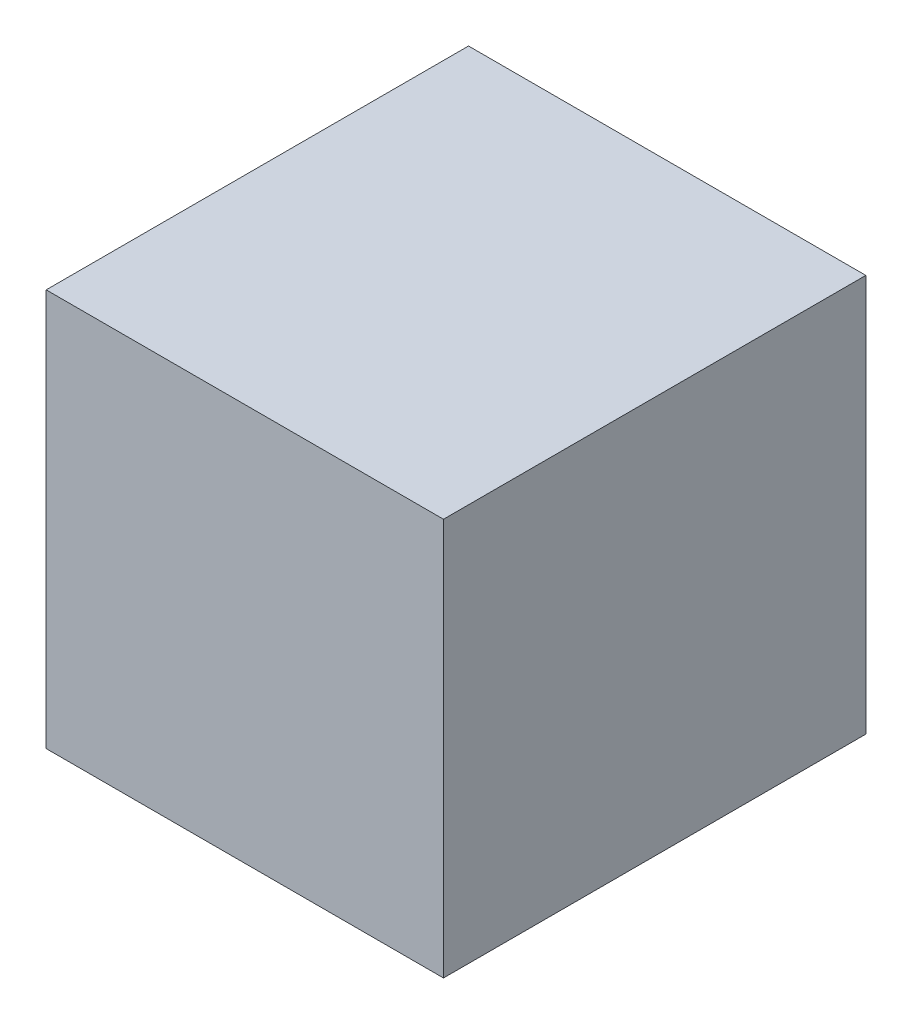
ISO-10303-21;
HEADER;
FILE_DESCRIPTION(('STEP AP214'),'2;1');
FILE_NAME('part.step','',(''),(''),'','','');
FILE_SCHEMA(('AUTOMOTIVE_DESIGN { 1 0 10303 214 1 1 1 1 }'));
ENDSEC;
DATA;
#1=APPLICATION_CONTEXT('core data for automotive mechanical design processes');
#2=APPLICATION_PROTOCOL_DEFINITION('international standard','automotive_design',2000,#1);
#3=PRODUCT_CONTEXT('',#1,'mechanical');
#4=PRODUCT('Part','Part','',(#3));
#5=PRODUCT_RELATED_PRODUCT_CATEGORY('part','',(#4));
#6=PRODUCT_DEFINITION_FORMATION('','',#4);
#7=PRODUCT_DEFINITION_CONTEXT('part definition',#1,'design');
#8=PRODUCT_DEFINITION('design','',#6,#7);
#9=PRODUCT_DEFINITION_SHAPE('','',#8);
#10=(LENGTH_UNIT() NAMED_UNIT(*) SI_UNIT(.MILLI.,.METRE.));
#11=(NAMED_UNIT(*) PLANE_ANGLE_UNIT() SI_UNIT($,.RADIAN.));
#12=(NAMED_UNIT(*) SI_UNIT($,.STERADIAN.) SOLID_ANGLE_UNIT());
#13=UNCERTAINTY_MEASURE_WITH_UNIT(LENGTH_MEASURE(1.E-05),#10,'distance_accuracy_value','');
#14=(GEOMETRIC_REPRESENTATION_CONTEXT(3) GLOBAL_UNCERTAINTY_ASSIGNED_CONTEXT((#13)) GLOBAL_UNIT_ASSIGNED_CONTEXT((#10,
#11,#12)) REPRESENTATION_CONTEXT('',''));
#15=CARTESIAN_POINT('',(0.,0.,0.));
#16=DIRECTION('',(0.,0.,1.));
#17=DIRECTION('',(1.,0.,0.));
#18=AXIS2_PLACEMENT_3D('',#15,#16,#17);
#19=CARTESIAN_POINT('',(0.,0.,1.34999984));
#20=DIRECTION('',(0.,0.,-1.));
#21=DIRECTION('',(0.,-1.,0.));
#22=AXIS2_PLACEMENT_3D('',#19,#20,#21);
#23=PLANE('',#22);
#24=DIRECTION('',(0.,-1.,0.));
#25=VECTOR('',#24,1.);
#26=CARTESIAN_POINT('',(0.635,0.635,1.34999984));
#27=LINE('',#26,#25);
#28=CARTESIAN_POINT('',(0.635,0.635,1.34999984));
#29=VERTEX_POINT('',#28);
#30=CARTESIAN_POINT('',(0.635,-0.635,1.34999984));
#31=VERTEX_POINT('',#30);
#32=EDGE_CURVE('E25',#29,#31,#27,.T.);
#33=ORIENTED_EDGE('',*,*,#32,.F.);
#34=DIRECTION('',(1.,0.,0.));
#35=VECTOR('',#34,1.);
#36=CARTESIAN_POINT('',(-0.635,0.635,1.34999984));
#37=LINE('',#36,#35);
#38=CARTESIAN_POINT('',(-0.635,0.635,1.34999984));
#39=VERTEX_POINT('',#38);
#40=EDGE_CURVE('E66',#39,#29,#37,.T.);
#41=ORIENTED_EDGE('',*,*,#40,.F.);
#42=DIRECTION('',(0.,1.,0.));
#43=VECTOR('',#42,1.);
#44=CARTESIAN_POINT('',(-0.635,-0.635,1.34999984));
#45=LINE('',#44,#43);
#46=CARTESIAN_POINT('',(-0.635,-0.635,1.34999984));
#47=VERTEX_POINT('',#46);
#48=EDGE_CURVE('E69',#47,#39,#45,.T.);
#49=ORIENTED_EDGE('',*,*,#48,.F.);
#50=DIRECTION('',(-1.,0.,0.));
#51=VECTOR('',#50,1.);
#52=CARTESIAN_POINT('',(0.635,-0.635,1.34999984));
#53=LINE('',#52,#51);
#54=EDGE_CURVE('E111',#31,#47,#53,.T.);
#55=ORIENTED_EDGE('',*,*,#54,.F.);
#56=EDGE_LOOP('',(#33,#41,#49,#55));
#57=FACE_BOUND('',#56,.T.);
#58=ADVANCED_FACE('F17',(#57),#23,.F.);
#59=CARTESIAN_POINT('',(0.,0.,0.));
#60=DIRECTION('',(0.,0.,-1.));
#61=DIRECTION('',(0.,-1.,0.));
#62=AXIS2_PLACEMENT_3D('',#59,#60,#61);
#63=PLANE('',#62);
#64=DIRECTION('',(-1.,0.,0.));
#65=VECTOR('',#64,1.);
#66=CARTESIAN_POINT('',(0.635,-0.635,0.));
#67=LINE('',#66,#65);
#68=CARTESIAN_POINT('',(0.635,-0.635,0.));
#69=VERTEX_POINT('',#68);
#70=CARTESIAN_POINT('',(-0.635,-0.635,0.));
#71=VERTEX_POINT('',#70);
#72=EDGE_CURVE('E90',#69,#71,#67,.T.);
#73=ORIENTED_EDGE('',*,*,#72,.T.);
#74=DIRECTION('',(0.,1.,0.));
#75=VECTOR('',#74,1.);
#76=CARTESIAN_POINT('',(-0.635,-0.635,0.));
#77=LINE('',#76,#75);
#78=CARTESIAN_POINT('',(-0.635,0.635,0.));
#79=VERTEX_POINT('',#78);
#80=EDGE_CURVE('E75',#71,#79,#77,.T.);
#81=ORIENTED_EDGE('',*,*,#80,.T.);
#82=DIRECTION('',(1.,0.,0.));
#83=VECTOR('',#82,1.);
#84=CARTESIAN_POINT('',(-0.635,0.635,0.));
#85=LINE('',#84,#83);
#86=CARTESIAN_POINT('',(0.635,0.635,0.));
#87=VERTEX_POINT('',#86);
#88=EDGE_CURVE('E80',#79,#87,#85,.T.);
#89=ORIENTED_EDGE('',*,*,#88,.T.);
#90=DIRECTION('',(0.,-1.,0.));
#91=VECTOR('',#90,1.);
#92=CARTESIAN_POINT('',(0.635,0.635,0.));
#93=LINE('',#92,#91);
#94=EDGE_CURVE('E11',#87,#69,#93,.T.);
#95=ORIENTED_EDGE('',*,*,#94,.T.);
#96=EDGE_LOOP('',(#73,#81,#89,#95));
#97=FACE_BOUND('',#96,.T.);
#98=ADVANCED_FACE('F181',(#97),#63,.T.);
#99=CARTESIAN_POINT('',(0.635,0.635,0.));
#100=DIRECTION('',(1.,0.,0.));
#101=DIRECTION('',(0.,1.,0.));
#102=AXIS2_PLACEMENT_3D('',#99,#100,#101);
#103=PLANE('',#102);
#104=DIRECTION('',(0.,0.,1.));
#105=VECTOR('',#104,1.);
#106=CARTESIAN_POINT('',(0.635,0.635,0.));
#107=LINE('',#106,#105);
#108=EDGE_CURVE('E74',#87,#29,#107,.T.);
#109=ORIENTED_EDGE('',*,*,#108,.T.);
#110=ORIENTED_EDGE('',*,*,#32,.T.);
#111=DIRECTION('',(0.,0.,1.));
#112=VECTOR('',#111,1.);
#113=CARTESIAN_POINT('',(0.635,-0.635,0.));
#114=LINE('',#113,#112);
#115=EDGE_CURVE('E110',#69,#31,#114,.T.);
#116=ORIENTED_EDGE('',*,*,#115,.F.);
#117=ORIENTED_EDGE('',*,*,#94,.F.);
#118=EDGE_LOOP('',(#109,#110,#116,#117));
#119=FACE_BOUND('',#118,.T.);
#120=ADVANCED_FACE('F108',(#119),#103,.T.);
#121=CARTESIAN_POINT('',(-0.635,0.635,0.));
#122=DIRECTION('',(0.,1.,0.));
#123=DIRECTION('',(1.,0.,0.));
#124=AXIS2_PLACEMENT_3D('',#121,#122,#123);
#125=PLANE('',#124);
#126=DIRECTION('',(0.,0.,1.));
#127=VECTOR('',#126,1.);
#128=CARTESIAN_POINT('',(-0.635,0.635,0.));
#129=LINE('',#128,#127);
#130=EDGE_CURVE('E78',#79,#39,#129,.T.);
#131=ORIENTED_EDGE('',*,*,#130,.T.);
#132=ORIENTED_EDGE('',*,*,#40,.T.);
#133=ORIENTED_EDGE('',*,*,#108,.F.);
#134=ORIENTED_EDGE('',*,*,#88,.F.);
#135=EDGE_LOOP('',(#131,#132,#133,#134));
#136=FACE_BOUND('',#135,.T.);
#137=ADVANCED_FACE('F79',(#136),#125,.T.);
#138=CARTESIAN_POINT('',(-0.635,-0.635,0.));
#139=DIRECTION('',(-1.,0.,0.));
#140=DIRECTION('',(0.,0.,1.));
#141=AXIS2_PLACEMENT_3D('',#138,#139,#140);
#142=PLANE('',#141);
#143=DIRECTION('',(0.,0.,1.));
#144=VECTOR('',#143,1.);
#145=CARTESIAN_POINT('',(-0.635,-0.635,0.));
#146=LINE('',#145,#144);
#147=EDGE_CURVE('E87',#71,#47,#146,.T.);
#148=ORIENTED_EDGE('',*,*,#147,.T.);
#149=ORIENTED_EDGE('',*,*,#48,.T.);
#150=ORIENTED_EDGE('',*,*,#130,.F.);
#151=ORIENTED_EDGE('',*,*,#80,.F.);
#152=EDGE_LOOP('',(#148,#149,#150,#151));
#153=FACE_BOUND('',#152,.T.);
#154=ADVANCED_FACE('F85',(#153),#142,.T.);
#155=CARTESIAN_POINT('',(0.635,-0.635,0.));
#156=DIRECTION('',(0.,-1.,0.));
#157=DIRECTION('',(0.,0.,-1.));
#158=AXIS2_PLACEMENT_3D('',#155,#156,#157);
#159=PLANE('',#158);
#160=ORIENTED_EDGE('',*,*,#115,.T.);
#161=ORIENTED_EDGE('',*,*,#54,.T.);
#162=ORIENTED_EDGE('',*,*,#147,.F.);
#163=ORIENTED_EDGE('',*,*,#72,.F.);
#164=EDGE_LOOP('',(#160,#161,#162,#163));
#165=FACE_BOUND('',#164,.T.);
#166=ADVANCED_FACE('F116',(#165),#159,.T.);
#167=CLOSED_SHELL('',(#58,#98,#120,#137,#154,#166));
#168=MANIFOLD_SOLID_BREP('B1',#167);
#169=ADVANCED_BREP_SHAPE_REPRESENTATION('',(#18,#168),#14);
#170=SHAPE_DEFINITION_REPRESENTATION(#9,#169);
ENDSEC;
END-ISO-10303-21;
